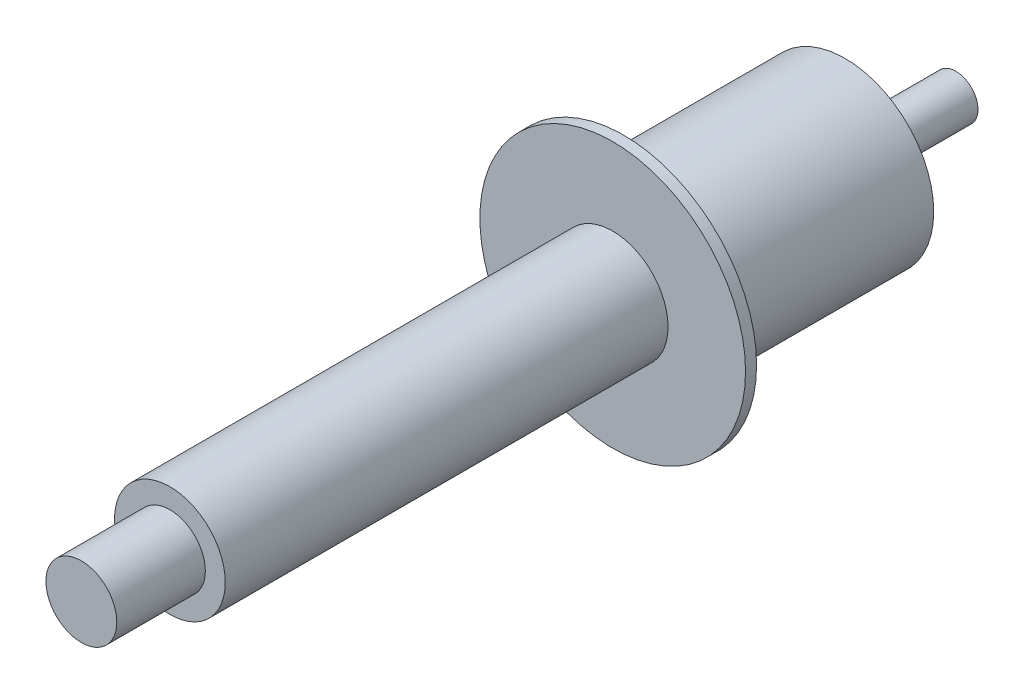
ISO-10303-21;
HEADER;
FILE_DESCRIPTION(('STEP AP214'),'2;1');
FILE_NAME('part.step','',(''),(''),'','','');
FILE_SCHEMA(('AUTOMOTIVE_DESIGN { 1 0 10303 214 1 1 1 1 }'));
ENDSEC;
DATA;
#1=APPLICATION_CONTEXT('core data for automotive mechanical design processes');
#2=APPLICATION_PROTOCOL_DEFINITION('international standard','automotive_design',2000,#1);
#3=PRODUCT_CONTEXT('',#1,'mechanical');
#4=PRODUCT('Part','Part','',(#3));
#5=PRODUCT_RELATED_PRODUCT_CATEGORY('part','',(#4));
#6=PRODUCT_DEFINITION_FORMATION('','',#4);
#7=PRODUCT_DEFINITION_CONTEXT('part definition',#1,'design');
#8=PRODUCT_DEFINITION('design','',#6,#7);
#9=PRODUCT_DEFINITION_SHAPE('','',#8);
#10=(LENGTH_UNIT() NAMED_UNIT(*) SI_UNIT(.MILLI.,.METRE.));
#11=(NAMED_UNIT(*) PLANE_ANGLE_UNIT() SI_UNIT($,.RADIAN.));
#12=(NAMED_UNIT(*) SI_UNIT($,.STERADIAN.) SOLID_ANGLE_UNIT());
#13=UNCERTAINTY_MEASURE_WITH_UNIT(LENGTH_MEASURE(1.E-05),#10,'distance_accuracy_value','');
#14=(GEOMETRIC_REPRESENTATION_CONTEXT(3) GLOBAL_UNCERTAINTY_ASSIGNED_CONTEXT((#13)) GLOBAL_UNIT_ASSIGNED_CONTEXT((#10,
#11,#12)) REPRESENTATION_CONTEXT('',''));
#15=CARTESIAN_POINT('',(0.,0.,0.));
#16=DIRECTION('',(0.,0.,1.));
#17=DIRECTION('',(1.,0.,0.));
#18=AXIS2_PLACEMENT_3D('',#15,#16,#17);
#19=CARTESIAN_POINT('',(0.,0.,177.5));
#20=DIRECTION('',(0.,0.,1.));
#21=DIRECTION('',(1.,0.,0.));
#22=AXIS2_PLACEMENT_3D('',#19,#20,#21);
#23=PLANE('',#22);
#24=CARTESIAN_POINT('',(0.,0.,177.5));
#25=DIRECTION('',(0.,0.,1.));
#26=DIRECTION('',(1.,0.,0.));
#27=AXIS2_PLACEMENT_3D('',#24,#25,#26);
#28=CIRCLE('',#27,12.5);
#29=CARTESIAN_POINT('',(12.5,0.,177.5));
#30=VERTEX_POINT('',#29);
#31=EDGE_CURVE('E59',#30,#30,#28,.T.);
#32=ORIENTED_EDGE('',*,*,#31,.T.);
#33=EDGE_LOOP('',(#32));
#34=FACE_BOUND('',#33,.T.);
#35=CARTESIAN_POINT('',(0.,0.,177.5));
#36=DIRECTION('',(0.,0.,1.));
#37=DIRECTION('',(1.,0.,0.));
#38=AXIS2_PLACEMENT_3D('',#35,#36,#37);
#39=CIRCLE('',#38,8.);
#40=CARTESIAN_POINT('',(8.,0.,177.5));
#41=VERTEX_POINT('',#40);
#42=EDGE_CURVE('E68',#41,#41,#39,.T.);
#43=ORIENTED_EDGE('',*,*,#42,.F.);
#44=EDGE_LOOP('',(#43));
#45=FACE_BOUND('',#44,.T.);
#46=ADVANCED_FACE('F31',(#34,#45),#23,.T.);
#47=CARTESIAN_POINT('',(0.,0.,77.5));
#48=DIRECTION('',(0.,0.,1.));
#49=DIRECTION('',(1.,0.,0.));
#50=AXIS2_PLACEMENT_3D('',#47,#48,#49);
#51=PLANE('',#50);
#52=CARTESIAN_POINT('',(0.,0.,77.5));
#53=DIRECTION('',(0.,0.,1.));
#54=DIRECTION('',(1.,0.,0.));
#55=AXIS2_PLACEMENT_3D('',#52,#53,#54);
#56=CIRCLE('',#55,30.);
#57=CARTESIAN_POINT('',(30.,0.,77.5));
#58=VERTEX_POINT('',#57);
#59=EDGE_CURVE('E53',#58,#58,#56,.T.);
#60=ORIENTED_EDGE('',*,*,#59,.T.);
#61=EDGE_LOOP('',(#60));
#62=FACE_BOUND('',#61,.T.);
#63=CARTESIAN_POINT('',(0.,0.,77.5));
#64=DIRECTION('',(0.,0.,1.));
#65=DIRECTION('',(1.,0.,0.));
#66=AXIS2_PLACEMENT_3D('',#63,#64,#65);
#67=CIRCLE('',#66,12.5);
#68=CARTESIAN_POINT('',(12.5,0.,77.5));
#69=VERTEX_POINT('',#68);
#70=EDGE_CURVE('E62',#69,#69,#67,.T.);
#71=ORIENTED_EDGE('',*,*,#70,.F.);
#72=EDGE_LOOP('',(#71));
#73=FACE_BOUND('',#72,.T.);
#74=ADVANCED_FACE('F84',(#62,#73),#51,.T.);
#75=CARTESIAN_POINT('',(0.,0.,20.));
#76=DIRECTION('',(0.,0.,-1.));
#77=DIRECTION('',(-1.,0.,0.));
#78=AXIS2_PLACEMENT_3D('',#75,#76,#77);
#79=CYLINDRICAL_SURFACE('',#78,5.);
#80=CARTESIAN_POINT('',(0.,0.,20.));
#81=DIRECTION('',(0.,0.,1.));
#82=DIRECTION('',(1.,0.,0.));
#83=AXIS2_PLACEMENT_3D('',#80,#81,#82);
#84=CIRCLE('',#83,5.);
#85=CARTESIAN_POINT('',(5.,0.,20.));
#86=VERTEX_POINT('',#85);
#87=EDGE_CURVE('E10',#86,#86,#84,.T.);
#88=ORIENTED_EDGE('',*,*,#87,.F.);
#89=EDGE_LOOP('',(#88));
#90=FACE_BOUND('',#89,.T.);
#91=CARTESIAN_POINT('',(0.,0.,0.));
#92=DIRECTION('',(0.,0.,1.));
#93=DIRECTION('',(1.,0.,0.));
#94=AXIS2_PLACEMENT_3D('',#91,#92,#93);
#95=CIRCLE('',#94,5.);
#96=CARTESIAN_POINT('',(5.,0.,0.));
#97=VERTEX_POINT('',#96);
#98=EDGE_CURVE('E35',#97,#97,#95,.T.);
#99=ORIENTED_EDGE('',*,*,#98,.T.);
#100=EDGE_LOOP('',(#99));
#101=FACE_BOUND('',#100,.T.);
#102=ADVANCED_FACE('F33',(#90,#101),#79,.T.);
#103=CARTESIAN_POINT('',(0.,0.,0.));
#104=DIRECTION('',(0.,0.,1.));
#105=DIRECTION('',(1.,0.,0.));
#106=AXIS2_PLACEMENT_3D('',#103,#104,#105);
#107=PLANE('',#106);
#108=ORIENTED_EDGE('',*,*,#98,.F.);
#109=EDGE_LOOP('',(#108));
#110=FACE_BOUND('',#109,.T.);
#111=ADVANCED_FACE('F117',(#110),#107,.F.);
#112=CARTESIAN_POINT('',(0.,0.,20.));
#113=DIRECTION('',(0.,0.,1.));
#114=DIRECTION('',(1.,0.,0.));
#115=AXIS2_PLACEMENT_3D('',#112,#113,#114);
#116=PLANE('',#115);
#117=CARTESIAN_POINT('',(0.,0.,20.));
#118=DIRECTION('',(0.,0.,1.));
#119=DIRECTION('',(1.,0.,0.));
#120=AXIS2_PLACEMENT_3D('',#117,#118,#119);
#121=CIRCLE('',#120,10.);
#122=CARTESIAN_POINT('',(10.,0.,20.));
#123=VERTEX_POINT('',#122);
#124=EDGE_CURVE('E44',#123,#123,#121,.T.);
#125=ORIENTED_EDGE('',*,*,#124,.F.);
#126=EDGE_LOOP('',(#125));
#127=FACE_BOUND('',#126,.T.);
#128=ORIENTED_EDGE('',*,*,#87,.T.);
#129=EDGE_LOOP('',(#128));
#130=FACE_BOUND('',#129,.T.);
#131=ADVANCED_FACE('F114',(#127,#130),#116,.F.);
#132=CARTESIAN_POINT('',(0.,0.,25.));
#133=DIRECTION('',(0.,0.,-1.));
#134=DIRECTION('',(-1.,0.,0.));
#135=AXIS2_PLACEMENT_3D('',#132,#133,#134);
#136=CYLINDRICAL_SURFACE('',#135,10.);
#137=CARTESIAN_POINT('',(0.,0.,25.));
#138=DIRECTION('',(0.,0.,1.));
#139=DIRECTION('',(1.,0.,0.));
#140=AXIS2_PLACEMENT_3D('',#137,#138,#139);
#141=CIRCLE('',#140,10.);
#142=CARTESIAN_POINT('',(10.,0.,25.));
#143=VERTEX_POINT('',#142);
#144=EDGE_CURVE('E42',#143,#143,#141,.T.);
#145=ORIENTED_EDGE('',*,*,#144,.F.);
#146=EDGE_LOOP('',(#145));
#147=FACE_BOUND('',#146,.T.);
#148=ORIENTED_EDGE('',*,*,#124,.T.);
#149=EDGE_LOOP('',(#148));
#150=FACE_BOUND('',#149,.T.);
#151=ADVANCED_FACE('F109',(#147,#150),#136,.T.);
#152=CARTESIAN_POINT('',(0.,0.,25.));
#153=DIRECTION('',(0.,0.,1.));
#154=DIRECTION('',(1.,0.,0.));
#155=AXIS2_PLACEMENT_3D('',#152,#153,#154);
#156=PLANE('',#155);
#157=CARTESIAN_POINT('',(0.,0.,25.));
#158=DIRECTION('',(0.,0.,1.));
#159=DIRECTION('',(1.,0.,0.));
#160=AXIS2_PLACEMENT_3D('',#157,#158,#159);
#161=CIRCLE('',#160,20.);
#162=CARTESIAN_POINT('',(20.,0.,25.));
#163=VERTEX_POINT('',#162);
#164=EDGE_CURVE('E50',#163,#163,#161,.T.);
#165=ORIENTED_EDGE('',*,*,#164,.F.);
#166=EDGE_LOOP('',(#165));
#167=FACE_BOUND('',#166,.T.);
#168=ORIENTED_EDGE('',*,*,#144,.T.);
#169=EDGE_LOOP('',(#168));
#170=FACE_BOUND('',#169,.T.);
#171=ADVANCED_FACE('F106',(#167,#170),#156,.F.);
#172=CARTESIAN_POINT('',(0.,0.,75.));
#173=DIRECTION('',(0.,0.,-1.));
#174=DIRECTION('',(-1.,0.,0.));
#175=AXIS2_PLACEMENT_3D('',#172,#173,#174);
#176=CYLINDRICAL_SURFACE('',#175,20.);
#177=CARTESIAN_POINT('',(0.,0.,75.));
#178=DIRECTION('',(0.,0.,1.));
#179=DIRECTION('',(1.,0.,0.));
#180=AXIS2_PLACEMENT_3D('',#177,#178,#179);
#181=CIRCLE('',#180,20.);
#182=CARTESIAN_POINT('',(20.,0.,75.));
#183=VERTEX_POINT('',#182);
#184=EDGE_CURVE('E47',#183,#183,#181,.T.);
#185=ORIENTED_EDGE('',*,*,#184,.F.);
#186=EDGE_LOOP('',(#185));
#187=FACE_BOUND('',#186,.T.);
#188=ORIENTED_EDGE('',*,*,#164,.T.);
#189=EDGE_LOOP('',(#188));
#190=FACE_BOUND('',#189,.T.);
#191=ADVANCED_FACE('F101',(#187,#190),#176,.T.);
#192=CARTESIAN_POINT('',(0.,0.,75.));
#193=DIRECTION('',(0.,0.,1.));
#194=DIRECTION('',(1.,0.,0.));
#195=AXIS2_PLACEMENT_3D('',#192,#193,#194);
#196=PLANE('',#195);
#197=CARTESIAN_POINT('',(0.,0.,75.));
#198=DIRECTION('',(0.,0.,1.));
#199=DIRECTION('',(1.,0.,0.));
#200=AXIS2_PLACEMENT_3D('',#197,#198,#199);
#201=CIRCLE('',#200,30.);
#202=CARTESIAN_POINT('',(30.,0.,75.));
#203=VERTEX_POINT('',#202);
#204=EDGE_CURVE('E56',#203,#203,#201,.T.);
#205=ORIENTED_EDGE('',*,*,#204,.F.);
#206=EDGE_LOOP('',(#205));
#207=FACE_BOUND('',#206,.T.);
#208=ORIENTED_EDGE('',*,*,#184,.T.);
#209=EDGE_LOOP('',(#208));
#210=FACE_BOUND('',#209,.T.);
#211=ADVANCED_FACE('F98',(#207,#210),#196,.F.);
#212=CARTESIAN_POINT('',(0.,0.,77.5));
#213=DIRECTION('',(0.,0.,-1.));
#214=DIRECTION('',(-1.,0.,0.));
#215=AXIS2_PLACEMENT_3D('',#212,#213,#214);
#216=CYLINDRICAL_SURFACE('',#215,30.);
#217=ORIENTED_EDGE('',*,*,#59,.F.);
#218=EDGE_LOOP('',(#217));
#219=FACE_BOUND('',#218,.T.);
#220=ORIENTED_EDGE('',*,*,#204,.T.);
#221=EDGE_LOOP('',(#220));
#222=FACE_BOUND('',#221,.T.);
#223=ADVANCED_FACE('F95',(#219,#222),#216,.T.);
#224=CARTESIAN_POINT('',(0.,0.,177.5));
#225=DIRECTION('',(0.,0.,-1.));
#226=DIRECTION('',(-1.,0.,0.));
#227=AXIS2_PLACEMENT_3D('',#224,#225,#226);
#228=CYLINDRICAL_SURFACE('',#227,12.5);
#229=ORIENTED_EDGE('',*,*,#31,.F.);
#230=EDGE_LOOP('',(#229));
#231=FACE_BOUND('',#230,.T.);
#232=ORIENTED_EDGE('',*,*,#70,.T.);
#233=EDGE_LOOP('',(#232));
#234=FACE_BOUND('',#233,.T.);
#235=ADVANCED_FACE('F79',(#231,#234),#228,.T.);
#236=CARTESIAN_POINT('',(0.,0.,197.5));
#237=DIRECTION('',(0.,0.,-1.));
#238=DIRECTION('',(-1.,0.,0.));
#239=AXIS2_PLACEMENT_3D('',#236,#237,#238);
#240=CYLINDRICAL_SURFACE('',#239,8.);
#241=CARTESIAN_POINT('',(0.,0.,197.5));
#242=DIRECTION('',(0.,0.,1.));
#243=DIRECTION('',(1.,0.,0.));
#244=AXIS2_PLACEMENT_3D('',#241,#242,#243);
#245=CIRCLE('',#244,8.);
#246=CARTESIAN_POINT('',(8.,0.,197.5));
#247=VERTEX_POINT('',#246);
#248=EDGE_CURVE('E65',#247,#247,#245,.T.);
#249=ORIENTED_EDGE('',*,*,#248,.F.);
#250=EDGE_LOOP('',(#249));
#251=FACE_BOUND('',#250,.T.);
#252=ORIENTED_EDGE('',*,*,#42,.T.);
#253=EDGE_LOOP('',(#252));
#254=FACE_BOUND('',#253,.T.);
#255=ADVANCED_FACE('F76',(#251,#254),#240,.T.);
#256=CARTESIAN_POINT('',(0.,0.,197.5));
#257=DIRECTION('',(0.,0.,1.));
#258=DIRECTION('',(1.,0.,0.));
#259=AXIS2_PLACEMENT_3D('',#256,#257,#258);
#260=PLANE('',#259);
#261=ORIENTED_EDGE('',*,*,#248,.T.);
#262=EDGE_LOOP('',(#261));
#263=FACE_BOUND('',#262,.T.);
#264=ADVANCED_FACE('F74',(#263),#260,.T.);
#265=CLOSED_SHELL('',(#46,#74,#102,#111,#131,#151,#171,#191,#211,#223,#235,#255,#264));
#266=MANIFOLD_SOLID_BREP('B2',#265);
#267=ADVANCED_BREP_SHAPE_REPRESENTATION('',(#18,#266),#14);
#268=SHAPE_DEFINITION_REPRESENTATION(#9,#267);
ENDSEC;
END-ISO-10303-21;
